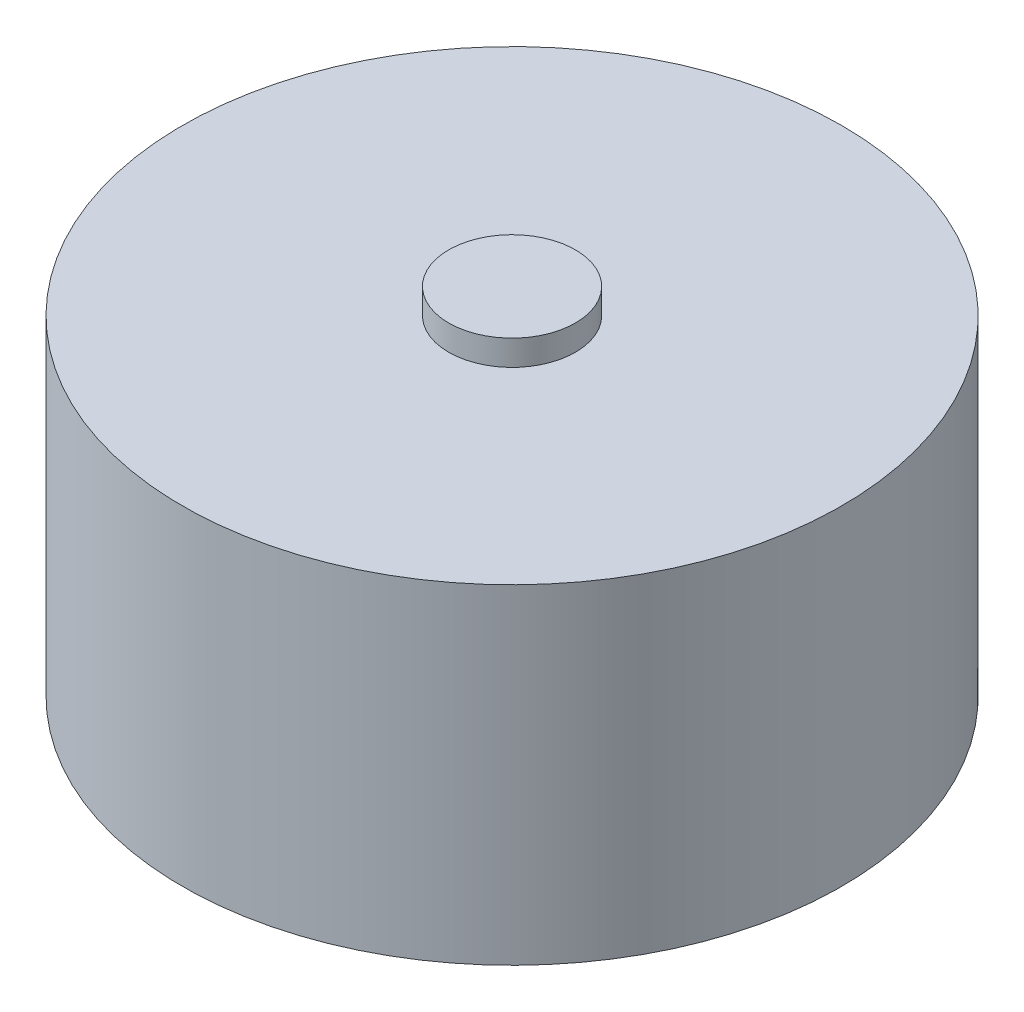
ISO-10303-21;
HEADER;
FILE_DESCRIPTION(('STEP AP214'),'2;1');
FILE_NAME('part.step','',(''),(''),'','','');
FILE_SCHEMA(('AUTOMOTIVE_DESIGN { 1 0 10303 214 1 1 1 1 }'));
ENDSEC;
DATA;
#1=APPLICATION_CONTEXT('core data for automotive mechanical design processes');
#2=APPLICATION_PROTOCOL_DEFINITION('international standard','automotive_design',2000,#1);
#3=PRODUCT_CONTEXT('',#1,'mechanical');
#4=PRODUCT('Part','Part','',(#3));
#5=PRODUCT_RELATED_PRODUCT_CATEGORY('part','',(#4));
#6=PRODUCT_DEFINITION_FORMATION('','',#4);
#7=PRODUCT_DEFINITION_CONTEXT('part definition',#1,'design');
#8=PRODUCT_DEFINITION('design','',#6,#7);
#9=PRODUCT_DEFINITION_SHAPE('','',#8);
#10=(LENGTH_UNIT() NAMED_UNIT(*) SI_UNIT(.MILLI.,.METRE.));
#11=(NAMED_UNIT(*) PLANE_ANGLE_UNIT() SI_UNIT($,.RADIAN.));
#12=(NAMED_UNIT(*) SI_UNIT($,.STERADIAN.) SOLID_ANGLE_UNIT());
#13=UNCERTAINTY_MEASURE_WITH_UNIT(LENGTH_MEASURE(1.E-05),#10,'distance_accuracy_value','');
#14=(GEOMETRIC_REPRESENTATION_CONTEXT(3) GLOBAL_UNCERTAINTY_ASSIGNED_CONTEXT((#13)) GLOBAL_UNIT_ASSIGNED_CONTEXT((#10,
#11,#12)) REPRESENTATION_CONTEXT('',''));
#15=CARTESIAN_POINT('',(0.,0.,0.));
#16=DIRECTION('',(0.,0.,1.));
#17=DIRECTION('',(1.,0.,0.));
#18=AXIS2_PLACEMENT_3D('',#15,#16,#17);
#19=CARTESIAN_POINT('',(0.,6.5,0.));
#20=DIRECTION('',(0.,-1.,0.));
#21=DIRECTION('',(0.,0.,-1.));
#22=AXIS2_PLACEMENT_3D('',#19,#20,#21);
#23=CYLINDRICAL_SURFACE('',#22,6.5);
#24=CARTESIAN_POINT('',(0.,6.5,0.));
#25=DIRECTION('',(0.,1.,0.));
#26=DIRECTION('',(0.,0.,1.));
#27=AXIS2_PLACEMENT_3D('',#24,#25,#26);
#28=CIRCLE('',#27,6.5);
#29=CARTESIAN_POINT('',(0.,6.5,-6.5));
#30=VERTEX_POINT('',#29);
#31=EDGE_CURVE('E10',#30,#30,#28,.T.);
#32=CARTESIAN_POINT('',(0.,0.,0.));
#33=DIRECTION('',(0.,1.,0.));
#34=DIRECTION('',(0.,0.,1.));
#35=AXIS2_PLACEMENT_3D('',#32,#33,#34);
#36=CIRCLE('',#35,6.5);
#37=CARTESIAN_POINT('',(0.,0.,-6.5));
#38=VERTEX_POINT('',#37);
#39=EDGE_CURVE('E34',#38,#38,#36,.T.);
#40=CARTESIAN_POINT('',(0.,6.5,-6.5));
#41=CARTESIAN_POINT('',(0.,6.43229166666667,-6.5));
#42=CARTESIAN_POINT('',(0.,6.36458333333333,-6.5));
#43=CARTESIAN_POINT('',(0.,6.22916666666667,-6.5));
#44=CARTESIAN_POINT('',(0.,6.16145833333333,-6.5));
#45=CARTESIAN_POINT('',(0.,6.02604166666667,-6.5));
#46=CARTESIAN_POINT('',(0.,5.95833333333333,-6.5));
#47=CARTESIAN_POINT('',(0.,5.82291666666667,-6.5));
#48=CARTESIAN_POINT('',(0.,5.75520833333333,-6.5));
#49=CARTESIAN_POINT('',(0.,5.61979166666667,-6.5));
#50=CARTESIAN_POINT('',(0.,5.55208333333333,-6.5));
#51=CARTESIAN_POINT('',(0.,5.41666666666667,-6.5));
#52=CARTESIAN_POINT('',(0.,5.34895833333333,-6.5));
#53=CARTESIAN_POINT('',(0.,5.21354166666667,-6.5));
#54=CARTESIAN_POINT('',(0.,5.14583333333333,-6.5));
#55=CARTESIAN_POINT('',(0.,5.01041666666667,-6.5));
#56=CARTESIAN_POINT('',(0.,4.94270833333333,-6.5));
#57=CARTESIAN_POINT('',(0.,4.80729166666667,-6.5));
#58=CARTESIAN_POINT('',(0.,4.73958333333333,-6.5));
#59=CARTESIAN_POINT('',(0.,4.60416666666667,-6.5));
#60=CARTESIAN_POINT('',(0.,4.53645833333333,-6.5));
#61=CARTESIAN_POINT('',(0.,4.40104166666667,-6.5));
#62=CARTESIAN_POINT('',(0.,4.33333333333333,-6.5));
#63=CARTESIAN_POINT('',(0.,4.19791666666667,-6.5));
#64=CARTESIAN_POINT('',(0.,4.13020833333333,-6.5));
#65=CARTESIAN_POINT('',(0.,3.99479166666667,-6.5));
#66=CARTESIAN_POINT('',(0.,3.92708333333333,-6.5));
#67=CARTESIAN_POINT('',(0.,3.79166666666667,-6.5));
#68=CARTESIAN_POINT('',(0.,3.72395833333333,-6.5));
#69=CARTESIAN_POINT('',(0.,3.58854166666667,-6.5));
#70=CARTESIAN_POINT('',(0.,3.52083333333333,-6.5));
#71=CARTESIAN_POINT('',(0.,3.38541666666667,-6.5));
#72=CARTESIAN_POINT('',(0.,3.31770833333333,-6.5));
#73=CARTESIAN_POINT('',(0.,3.18229166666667,-6.5));
#74=CARTESIAN_POINT('',(0.,3.11458333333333,-6.5));
#75=CARTESIAN_POINT('',(0.,2.97916666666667,-6.5));
#76=CARTESIAN_POINT('',(0.,2.91145833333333,-6.5));
#77=CARTESIAN_POINT('',(0.,2.77604166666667,-6.5));
#78=CARTESIAN_POINT('',(0.,2.70833333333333,-6.5));
#79=CARTESIAN_POINT('',(0.,2.57291666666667,-6.5));
#80=CARTESIAN_POINT('',(0.,2.50520833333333,-6.5));
#81=CARTESIAN_POINT('',(0.,2.36979166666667,-6.5));
#82=CARTESIAN_POINT('',(0.,2.30208333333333,-6.5));
#83=CARTESIAN_POINT('',(0.,2.16666666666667,-6.5));
#84=CARTESIAN_POINT('',(0.,2.09895833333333,-6.5));
#85=CARTESIAN_POINT('',(0.,1.96354166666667,-6.5));
#86=CARTESIAN_POINT('',(0.,1.89583333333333,-6.5));
#87=CARTESIAN_POINT('',(0.,1.76041666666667,-6.5));
#88=CARTESIAN_POINT('',(0.,1.69270833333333,-6.5));
#89=CARTESIAN_POINT('',(0.,1.55729166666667,-6.5));
#90=CARTESIAN_POINT('',(0.,1.48958333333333,-6.5));
#91=CARTESIAN_POINT('',(0.,1.35416666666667,-6.5));
#92=CARTESIAN_POINT('',(0.,1.28645833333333,-6.5));
#93=CARTESIAN_POINT('',(0.,1.15104166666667,-6.5));
#94=CARTESIAN_POINT('',(0.,1.08333333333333,-6.5));
#95=CARTESIAN_POINT('',(0.,0.947916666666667,-6.5));
#96=CARTESIAN_POINT('',(0.,0.880208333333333,-6.5));
#97=CARTESIAN_POINT('',(0.,0.744791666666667,-6.5));
#98=CARTESIAN_POINT('',(0.,0.677083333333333,-6.5));
#99=CARTESIAN_POINT('',(0.,0.541666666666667,-6.5));
#100=CARTESIAN_POINT('',(0.,0.473958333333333,-6.5));
#101=CARTESIAN_POINT('',(0.,0.338541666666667,-6.5));
#102=CARTESIAN_POINT('',(0.,0.270833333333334,-6.5));
#103=CARTESIAN_POINT('',(0.,0.135416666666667,-6.5));
#104=CARTESIAN_POINT('',(0.,0.0677083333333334,-6.5));
#105=CARTESIAN_POINT('',(0.,0.,-6.5));
#106=B_SPLINE_CURVE_WITH_KNOTS('',3,(#40,#41,#42,#43,#44,#45,#46,#47,#48,#49,#50,#51,#52,#53,
#54,#55,#56,#57,#58,#59,#60,#61,#62,#63,#64,#65,#66,#67,#68,#69,#70,#71,#72,#73,#74,#75,#76,#77,
#78,#79,#80,#81,#82,#83,#84,#85,#86,#87,#88,#89,#90,#91,#92,#93,#94,#95,#96,#97,#98,#99,#100,
#101,#102,#103,#104,#105),.UNSPECIFIED.,.F.,.F.,(4,2,2,2,2,2,2,2,2,2,2,2,2,2,2,2,2,2,2,2,2,2,2,
2,2,2,2,2,2,2,2,2,4),(0.,0.203124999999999,0.40625,0.609375,0.812499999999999,1.015625,1.21875,
1.421875,1.625,1.828125,2.03125,2.234375,2.4375,2.640625,2.84375,3.046875,3.25,3.453125,3.65625,
3.859375,4.0625,4.265625,4.46875,4.671875,4.875,5.078125,5.28125,5.484375,5.6875,5.890625,
6.09375,6.296875,6.5),.UNSPECIFIED.);
#107=EDGE_CURVE('BSEAM31',#30,#38,#106,.T.);
#108=ORIENTED_EDGE('',*,*,#31,.F.);
#109=ORIENTED_EDGE('',*,*,#39,.T.);
#110=ORIENTED_EDGE('',*,*,#107,.T.);
#111=ORIENTED_EDGE('',*,*,#107,.F.);
#112=EDGE_LOOP('',(#108,#110,#109,#111));
#113=FACE_BOUND('',#112,.T.);
#114=ADVANCED_FACE('F31',(#113),#23,.T.);
#115=CARTESIAN_POINT('',(0.,6.5,0.));
#116=DIRECTION('',(0.,1.,0.));
#117=DIRECTION('',(0.,0.,1.));
#118=AXIS2_PLACEMENT_3D('',#115,#116,#117);
#119=PLANE('',#118);
#120=CARTESIAN_POINT('',(0.,6.5,0.));
#121=DIRECTION('',(0.,1.,0.));
#122=DIRECTION('',(0.,0.,1.));
#123=AXIS2_PLACEMENT_3D('',#120,#121,#122);
#124=CIRCLE('',#123,1.25);
#125=CARTESIAN_POINT('',(0.,6.5,1.25));
#126=VERTEX_POINT('',#125);
#127=EDGE_CURVE('E43',#126,#126,#124,.T.);
#128=ORIENTED_EDGE('',*,*,#127,.F.);
#129=EDGE_LOOP('',(#128));
#130=FACE_BOUND('',#129,.T.);
#131=ORIENTED_EDGE('',*,*,#31,.T.);
#132=EDGE_LOOP('',(#131));
#133=FACE_BOUND('',#132,.T.);
#134=ADVANCED_FACE('F58',(#130,#133),#119,.T.);
#135=CARTESIAN_POINT('',(0.,0.,0.));
#136=DIRECTION('',(0.,1.,0.));
#137=DIRECTION('',(0.,0.,1.));
#138=AXIS2_PLACEMENT_3D('',#135,#136,#137);
#139=PLANE('',#138);
#140=ORIENTED_EDGE('',*,*,#39,.F.);
#141=EDGE_LOOP('',(#140));
#142=FACE_BOUND('',#141,.T.);
#143=ADVANCED_FACE('F54',(#142),#139,.F.);
#144=CARTESIAN_POINT('',(0.,7.,0.));
#145=DIRECTION('',(0.,-1.,0.));
#146=DIRECTION('',(0.,0.,-1.));
#147=AXIS2_PLACEMENT_3D('',#144,#145,#146);
#148=CYLINDRICAL_SURFACE('',#147,1.25);
#149=CARTESIAN_POINT('',(0.,7.,0.));
#150=DIRECTION('',(0.,1.,0.));
#151=DIRECTION('',(0.,0.,1.));
#152=AXIS2_PLACEMENT_3D('',#149,#150,#151);
#153=CIRCLE('',#152,1.25);
#154=CARTESIAN_POINT('',(0.,7.,1.25));
#155=VERTEX_POINT('',#154);
#156=EDGE_CURVE('E41',#155,#155,#153,.T.);
#157=ORIENTED_EDGE('',*,*,#156,.F.);
#158=EDGE_LOOP('',(#157));
#159=FACE_BOUND('',#158,.T.);
#160=ORIENTED_EDGE('',*,*,#127,.T.);
#161=EDGE_LOOP('',(#160));
#162=FACE_BOUND('',#161,.T.);
#163=ADVANCED_FACE('F51',(#159,#162),#148,.T.);
#164=CARTESIAN_POINT('',(0.,7.,0.));
#165=DIRECTION('',(0.,1.,0.));
#166=DIRECTION('',(0.,0.,1.));
#167=AXIS2_PLACEMENT_3D('',#164,#165,#166);
#168=PLANE('',#167);
#169=ORIENTED_EDGE('',*,*,#156,.T.);
#170=EDGE_LOOP('',(#169));
#171=FACE_BOUND('',#170,.T.);
#172=ADVANCED_FACE('F49',(#171),#168,.T.);
#173=CLOSED_SHELL('',(#114,#134,#143,#163,#172));
#174=MANIFOLD_SOLID_BREP('B2',#173);
#175=ADVANCED_BREP_SHAPE_REPRESENTATION('',(#18,#174),#14);
#176=SHAPE_DEFINITION_REPRESENTATION(#9,#175);
ENDSEC;
END-ISO-10303-21;
